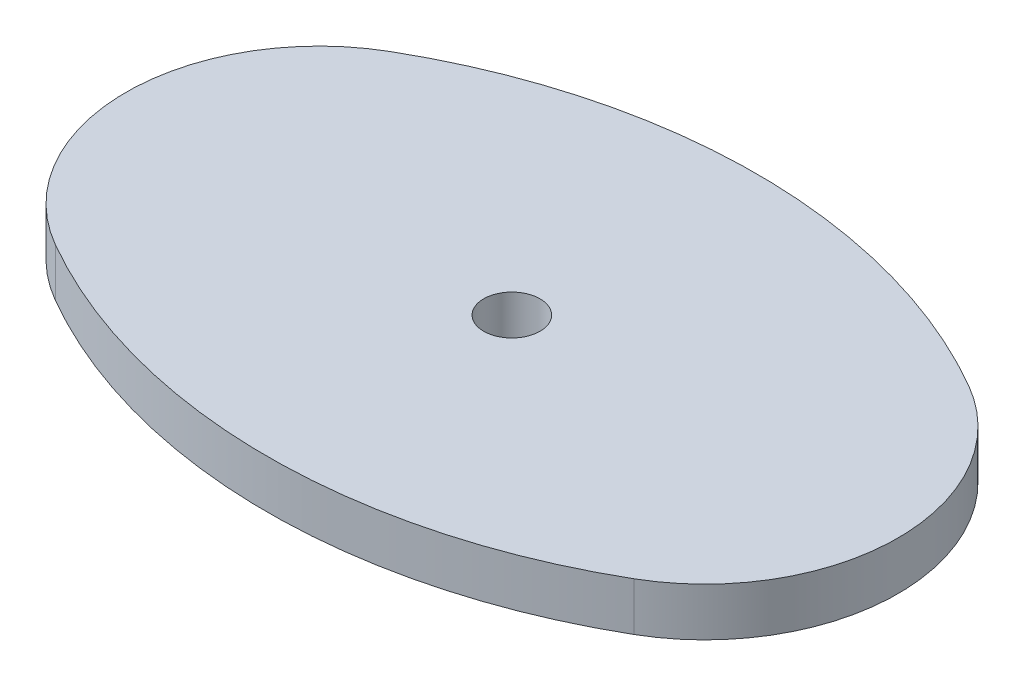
ISO-10303-21;
HEADER;
FILE_DESCRIPTION(('STEP AP214'),'2;1');
FILE_NAME('part.step','',(''),(''),'','','');
FILE_SCHEMA(('AUTOMOTIVE_DESIGN { 1 0 10303 214 1 1 1 1 }'));
ENDSEC;
DATA;
#1=APPLICATION_CONTEXT('core data for automotive mechanical design processes');
#2=APPLICATION_PROTOCOL_DEFINITION('international standard','automotive_design',2000,#1);
#3=PRODUCT_CONTEXT('',#1,'mechanical');
#4=PRODUCT('Part','Part','',(#3));
#5=PRODUCT_RELATED_PRODUCT_CATEGORY('part','',(#4));
#6=PRODUCT_DEFINITION_FORMATION('','',#4);
#7=PRODUCT_DEFINITION_CONTEXT('part definition',#1,'design');
#8=PRODUCT_DEFINITION('design','',#6,#7);
#9=PRODUCT_DEFINITION_SHAPE('','',#8);
#10=(LENGTH_UNIT() NAMED_UNIT(*) SI_UNIT(.MILLI.,.METRE.));
#11=(NAMED_UNIT(*) PLANE_ANGLE_UNIT() SI_UNIT($,.RADIAN.));
#12=(NAMED_UNIT(*) SI_UNIT($,.STERADIAN.) SOLID_ANGLE_UNIT());
#13=UNCERTAINTY_MEASURE_WITH_UNIT(LENGTH_MEASURE(1.E-05),#10,'distance_accuracy_value','');
#14=(GEOMETRIC_REPRESENTATION_CONTEXT(3) GLOBAL_UNCERTAINTY_ASSIGNED_CONTEXT((#13)) GLOBAL_UNIT_ASSIGNED_CONTEXT((#10,
#11,#12)) REPRESENTATION_CONTEXT('',''));
#15=CARTESIAN_POINT('',(0.,0.,0.));
#16=DIRECTION('',(0.,0.,1.));
#17=DIRECTION('',(1.,0.,0.));
#18=AXIS2_PLACEMENT_3D('',#15,#16,#17);
#19=CARTESIAN_POINT('',(-5.9844473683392,3.,10.3952962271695));
#20=DIRECTION('',(0.,1.,0.));
#21=DIRECTION('',(0.,0.,1.));
#22=AXIS2_PLACEMENT_3D('',#19,#20,#21);
#23=PLANE('',#22);
#24=CARTESIAN_POINT('',(0.0103684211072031,3.,20.790592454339));
#25=DIRECTION('',(0.,1.,0.));
#26=DIRECTION('',(0.,0.,1.));
#27=AXIS2_PLACEMENT_3D('',#24,#25,#26);
#28=CIRCLE('',#27,36.);
#29=CARTESIAN_POINT('',(17.9948157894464,3.,-10.3952962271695));
#30=VERTEX_POINT('',#29);
#31=CARTESIAN_POINT('',(-17.974078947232,3.,-10.3952962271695));
#32=VERTEX_POINT('',#31);
#33=EDGE_CURVE('E99',#30,#32,#28,.T.);
#34=ORIENTED_EDGE('',*,*,#33,.T.);
#35=CARTESIAN_POINT('',(-11.9792631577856,3.,0.));
#36=DIRECTION('',(0.,1.,0.));
#37=DIRECTION('',(0.,0.,-1.));
#38=AXIS2_PLACEMENT_3D('',#35,#36,#37);
#39=CIRCLE('',#38,12.);
#40=CARTESIAN_POINT('',(-17.974078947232,3.,10.3952962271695));
#41=VERTEX_POINT('',#40);
#42=EDGE_CURVE('E84',#32,#41,#39,.T.);
#43=ORIENTED_EDGE('',*,*,#42,.T.);
#44=CARTESIAN_POINT('',(0.0103684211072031,3.,-20.790592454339));
#45=DIRECTION('',(0.,1.,0.));
#46=DIRECTION('',(0.,0.,1.));
#47=AXIS2_PLACEMENT_3D('',#44,#45,#46);
#48=CIRCLE('',#47,36.);
#49=CARTESIAN_POINT('',(17.9948157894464,3.,10.3952962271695));
#50=VERTEX_POINT('',#49);
#51=EDGE_CURVE('E50',#41,#50,#48,.T.);
#52=ORIENTED_EDGE('',*,*,#51,.T.);
#53=CARTESIAN_POINT('',(12.,3.,0.));
#54=DIRECTION('',(0.,1.,0.));
#55=DIRECTION('',(0.,0.,1.));
#56=AXIS2_PLACEMENT_3D('',#53,#54,#55);
#57=CIRCLE('',#56,12.);
#58=EDGE_CURVE('E45',#50,#30,#57,.T.);
#59=ORIENTED_EDGE('',*,*,#58,.T.);
#60=EDGE_LOOP('',(#34,#43,#52,#59));
#61=FACE_BOUND('',#60,.T.);
#62=CARTESIAN_POINT('',(0.,3.,0.));
#63=DIRECTION('',(0.,1.,0.));
#64=DIRECTION('',(0.,0.,1.));
#65=AXIS2_PLACEMENT_3D('',#62,#63,#64);
#66=CIRCLE('',#65,1.75);
#67=CARTESIAN_POINT('',(0.,3.,1.75));
#68=VERTEX_POINT('',#67);
#69=EDGE_CURVE('E89',#68,#68,#66,.T.);
#70=ORIENTED_EDGE('',*,*,#69,.F.);
#71=EDGE_LOOP('',(#70));
#72=FACE_BOUND('',#71,.T.);
#73=ADVANCED_FACE('F30',(#61,#72),#23,.T.);
#74=CARTESIAN_POINT('',(-5.9844473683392,0.,10.3952962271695));
#75=DIRECTION('',(0.,1.,0.));
#76=DIRECTION('',(0.,0.,1.));
#77=AXIS2_PLACEMENT_3D('',#74,#75,#76);
#78=PLANE('',#77);
#79=CARTESIAN_POINT('',(0.0103684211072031,0.,20.790592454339));
#80=DIRECTION('',(0.,1.,0.));
#81=DIRECTION('',(0.,0.,1.));
#82=AXIS2_PLACEMENT_3D('',#79,#80,#81);
#83=CIRCLE('',#82,36.);
#84=CARTESIAN_POINT('',(17.9948157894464,0.,-10.3952962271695));
#85=VERTEX_POINT('',#84);
#86=CARTESIAN_POINT('',(-17.974078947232,0.,-10.3952962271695));
#87=VERTEX_POINT('',#86);
#88=EDGE_CURVE('E76',#85,#87,#83,.T.);
#89=ORIENTED_EDGE('',*,*,#88,.F.);
#90=CARTESIAN_POINT('',(12.,0.,0.));
#91=DIRECTION('',(0.,1.,0.));
#92=DIRECTION('',(0.,0.,1.));
#93=AXIS2_PLACEMENT_3D('',#90,#91,#92);
#94=CIRCLE('',#93,12.);
#95=CARTESIAN_POINT('',(17.9948157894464,0.,10.3952962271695));
#96=VERTEX_POINT('',#95);
#97=EDGE_CURVE('E97',#96,#85,#94,.T.);
#98=ORIENTED_EDGE('',*,*,#97,.F.);
#99=CARTESIAN_POINT('',(0.0103684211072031,0.,-20.790592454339));
#100=DIRECTION('',(0.,1.,0.));
#101=DIRECTION('',(0.,0.,1.));
#102=AXIS2_PLACEMENT_3D('',#99,#100,#101);
#103=CIRCLE('',#102,36.);
#104=CARTESIAN_POINT('',(-17.974078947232,0.,10.3952962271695));
#105=VERTEX_POINT('',#104);
#106=EDGE_CURVE('E77',#105,#96,#103,.T.);
#107=ORIENTED_EDGE('',*,*,#106,.F.);
#108=CARTESIAN_POINT('',(-11.9792631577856,0.,0.));
#109=DIRECTION('',(0.,1.,0.));
#110=DIRECTION('',(0.,0.,-1.));
#111=AXIS2_PLACEMENT_3D('',#108,#109,#110);
#112=CIRCLE('',#111,12.);
#113=EDGE_CURVE('E71',#87,#105,#112,.T.);
#114=ORIENTED_EDGE('',*,*,#113,.F.);
#115=EDGE_LOOP('',(#89,#98,#107,#114));
#116=FACE_BOUND('',#115,.T.);
#117=CARTESIAN_POINT('',(0.,0.,0.));
#118=DIRECTION('',(0.,1.,0.));
#119=DIRECTION('',(0.,0.,1.));
#120=AXIS2_PLACEMENT_3D('',#117,#118,#119);
#121=CIRCLE('',#120,1.75);
#122=CARTESIAN_POINT('',(0.,0.,1.75));
#123=VERTEX_POINT('',#122);
#124=EDGE_CURVE('E92',#123,#123,#121,.T.);
#125=ORIENTED_EDGE('',*,*,#124,.T.);
#126=EDGE_LOOP('',(#125));
#127=FACE_BOUND('',#126,.T.);
#128=ADVANCED_FACE('F72',(#116,#127),#78,.F.);
#129=CARTESIAN_POINT('',(0.0103684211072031,3.,20.790592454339));
#130=DIRECTION('',(0.,-1.,0.));
#131=DIRECTION('',(0.,0.,-1.));
#132=AXIS2_PLACEMENT_3D('',#129,#130,#131);
#133=CYLINDRICAL_SURFACE('',#132,36.);
#134=ORIENTED_EDGE('',*,*,#88,.T.);
#135=DIRECTION('',(0.,-1.,0.));
#136=VECTOR('',#135,1.);
#137=CARTESIAN_POINT('',(-17.974078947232,3.,-10.3952962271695));
#138=LINE('',#137,#136);
#139=EDGE_CURVE('E11',#32,#87,#138,.T.);
#140=ORIENTED_EDGE('',*,*,#139,.F.);
#141=ORIENTED_EDGE('',*,*,#33,.F.);
#142=DIRECTION('',(0.,-1.,0.));
#143=VECTOR('',#142,1.);
#144=CARTESIAN_POINT('',(17.9948157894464,3.,-10.3952962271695));
#145=LINE('',#144,#143);
#146=EDGE_CURVE('E88',#30,#85,#145,.T.);
#147=ORIENTED_EDGE('',*,*,#146,.T.);
#148=EDGE_LOOP('',(#134,#140,#141,#147));
#149=FACE_BOUND('',#148,.T.);
#150=ADVANCED_FACE('F32',(#149),#133,.T.);
#151=CARTESIAN_POINT('',(-11.9792631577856,3.,0.));
#152=DIRECTION('',(0.,-1.,0.));
#153=DIRECTION('',(0.,0.,-1.));
#154=AXIS2_PLACEMENT_3D('',#151,#152,#153);
#155=CYLINDRICAL_SURFACE('',#154,12.);
#156=ORIENTED_EDGE('',*,*,#113,.T.);
#157=DIRECTION('',(0.,-1.,0.));
#158=VECTOR('',#157,1.);
#159=CARTESIAN_POINT('',(-17.974078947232,3.,10.3952962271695));
#160=LINE('',#159,#158);
#161=EDGE_CURVE('E38',#41,#105,#160,.T.);
#162=ORIENTED_EDGE('',*,*,#161,.F.);
#163=ORIENTED_EDGE('',*,*,#42,.F.);
#164=ORIENTED_EDGE('',*,*,#139,.T.);
#165=EDGE_LOOP('',(#156,#162,#163,#164));
#166=FACE_BOUND('',#165,.T.);
#167=ADVANCED_FACE('F83',(#166),#155,.T.);
#168=CARTESIAN_POINT('',(0.0103684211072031,3.,-20.790592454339));
#169=DIRECTION('',(0.,-1.,0.));
#170=DIRECTION('',(0.,0.,-1.));
#171=AXIS2_PLACEMENT_3D('',#168,#169,#170);
#172=CYLINDRICAL_SURFACE('',#171,36.);
#173=ORIENTED_EDGE('',*,*,#106,.T.);
#174=DIRECTION('',(0.,-1.,0.));
#175=VECTOR('',#174,1.);
#176=CARTESIAN_POINT('',(17.9948157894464,3.,10.3952962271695));
#177=LINE('',#176,#175);
#178=EDGE_CURVE('E105',#50,#96,#177,.T.);
#179=ORIENTED_EDGE('',*,*,#178,.F.);
#180=ORIENTED_EDGE('',*,*,#51,.F.);
#181=ORIENTED_EDGE('',*,*,#161,.T.);
#182=EDGE_LOOP('',(#173,#179,#180,#181));
#183=FACE_BOUND('',#182,.T.);
#184=ADVANCED_FACE('F108',(#183),#172,.T.);
#185=CARTESIAN_POINT('',(12.,3.,0.));
#186=DIRECTION('',(0.,-1.,0.));
#187=DIRECTION('',(0.,0.,-1.));
#188=AXIS2_PLACEMENT_3D('',#185,#186,#187);
#189=CYLINDRICAL_SURFACE('',#188,12.);
#190=ORIENTED_EDGE('',*,*,#97,.T.);
#191=ORIENTED_EDGE('',*,*,#146,.F.);
#192=ORIENTED_EDGE('',*,*,#58,.F.);
#193=ORIENTED_EDGE('',*,*,#178,.T.);
#194=EDGE_LOOP('',(#190,#191,#192,#193));
#195=FACE_BOUND('',#194,.T.);
#196=ADVANCED_FACE('F110',(#195),#189,.T.);
#197=CARTESIAN_POINT('',(0.,3.,0.));
#198=DIRECTION('',(0.,-1.,0.));
#199=DIRECTION('',(0.,0.,-1.));
#200=AXIS2_PLACEMENT_3D('',#197,#198,#199);
#201=CYLINDRICAL_SURFACE('',#200,1.75);
#202=ORIENTED_EDGE('',*,*,#69,.T.);
#203=EDGE_LOOP('',(#202));
#204=FACE_BOUND('',#203,.T.);
#205=ORIENTED_EDGE('',*,*,#124,.F.);
#206=EDGE_LOOP('',(#205));
#207=FACE_BOUND('',#206,.T.);
#208=ADVANCED_FACE('F116',(#204,#207),#201,.F.);
#209=CLOSED_SHELL('',(#73,#128,#150,#167,#184,#196,#208));
#210=MANIFOLD_SOLID_BREP('B2',#209);
#211=ADVANCED_BREP_SHAPE_REPRESENTATION('',(#18,#210),#14);
#212=SHAPE_DEFINITION_REPRESENTATION(#9,#211);
ENDSEC;
END-ISO-10303-21;
